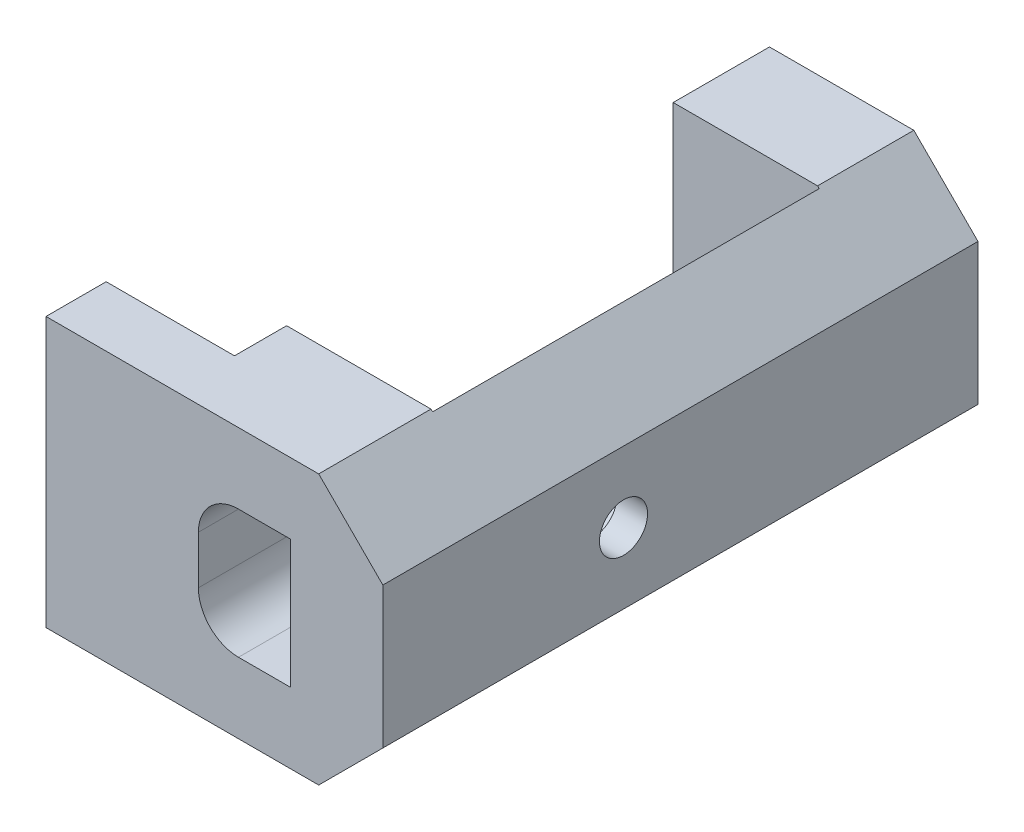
ISO-10303-21;
HEADER;
FILE_DESCRIPTION(('STEP AP214'),'2;1');
FILE_NAME('part.step','',(''),(''),'','','');
FILE_SCHEMA(('AUTOMOTIVE_DESIGN { 1 0 10303 214 1 1 1 1 }'));
ENDSEC;
DATA;
#1=APPLICATION_CONTEXT('core data for automotive mechanical design processes');
#2=APPLICATION_PROTOCOL_DEFINITION('international standard','automotive_design',2000,#1);
#3=PRODUCT_CONTEXT('',#1,'mechanical');
#4=PRODUCT('Part','Part','',(#3));
#5=PRODUCT_RELATED_PRODUCT_CATEGORY('part','',(#4));
#6=PRODUCT_DEFINITION_FORMATION('','',#4);
#7=PRODUCT_DEFINITION_CONTEXT('part definition',#1,'design');
#8=PRODUCT_DEFINITION('design','',#6,#7);
#9=PRODUCT_DEFINITION_SHAPE('','',#8);
#10=(LENGTH_UNIT() NAMED_UNIT(*) SI_UNIT(.MILLI.,.METRE.));
#11=(NAMED_UNIT(*) PLANE_ANGLE_UNIT() SI_UNIT($,.RADIAN.));
#12=(NAMED_UNIT(*) SI_UNIT($,.STERADIAN.) SOLID_ANGLE_UNIT());
#13=UNCERTAINTY_MEASURE_WITH_UNIT(LENGTH_MEASURE(1.E-05),#10,'distance_accuracy_value','');
#14=(GEOMETRIC_REPRESENTATION_CONTEXT(3) GLOBAL_UNCERTAINTY_ASSIGNED_CONTEXT((#13)) GLOBAL_UNIT_ASSIGNED_CONTEXT((#10,
#11,#12)) REPRESENTATION_CONTEXT('',''));
#15=CARTESIAN_POINT('',(0.,0.,0.));
#16=DIRECTION('',(0.,0.,1.));
#17=DIRECTION('',(1.,0.,0.));
#18=AXIS2_PLACEMENT_3D('',#15,#16,#17);
#19=CARTESIAN_POINT('',(0.,16.8,0.));
#20=DIRECTION('',(0.,-1.,0.));
#21=DIRECTION('',(0.,0.,-1.));
#22=AXIS2_PLACEMENT_3D('',#19,#20,#21);
#23=PLANE('',#22);
#24=DIRECTION('',(1.,0.,0.));
#25=VECTOR('',#24,1.);
#26=CARTESIAN_POINT('',(0.,16.8,-4.));
#27=LINE('',#26,#25);
#28=CARTESIAN_POINT('',(0.,16.8,-4.));
#29=VERTEX_POINT('',#28);
#30=CARTESIAN_POINT('',(8.99999999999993,16.8,-4.));
#31=VERTEX_POINT('',#30);
#32=EDGE_CURVE('E226',#29,#31,#27,.T.);
#33=ORIENTED_EDGE('',*,*,#32,.F.);
#34=DIRECTION('',(0.,0.,1.));
#35=VECTOR('',#34,1.);
#36=CARTESIAN_POINT('',(0.,16.8,0.));
#37=LINE('',#36,#35);
#38=CARTESIAN_POINT('',(0.,16.8,-0.750000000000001));
#39=VERTEX_POINT('',#38);
#40=EDGE_CURVE('E225',#29,#39,#37,.T.);
#41=ORIENTED_EDGE('',*,*,#40,.T.);
#42=DIRECTION('',(1.,0.,0.));
#43=VECTOR('',#42,1.);
#44=CARTESIAN_POINT('',(-8.,16.8,-0.749999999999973));
#45=LINE('',#44,#43);
#46=CARTESIAN_POINT('',(-8.,16.8,-0.749999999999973));
#47=VERTEX_POINT('',#46);
#48=EDGE_CURVE('E365',#47,#39,#45,.T.);
#49=ORIENTED_EDGE('',*,*,#48,.F.);
#50=DIRECTION('',(0.,0.,-1.));
#51=VECTOR('',#50,1.);
#52=CARTESIAN_POINT('',(-8.,16.8,0.));
#53=LINE('',#52,#51);
#54=CARTESIAN_POINT('',(-7.99999999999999,16.8,3.00000000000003));
#55=VERTEX_POINT('',#54);
#56=EDGE_CURVE('E363',#55,#47,#53,.T.);
#57=ORIENTED_EDGE('',*,*,#56,.F.);
#58=DIRECTION('',(-1.,0.,0.));
#59=VECTOR('',#58,1.);
#60=CARTESIAN_POINT('',(8.99999999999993,16.8,3.));
#61=LINE('',#60,#59);
#62=CARTESIAN_POINT('',(8.99999999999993,16.8,3.));
#63=VERTEX_POINT('',#62);
#64=EDGE_CURVE('E382',#63,#55,#61,.T.);
#65=ORIENTED_EDGE('',*,*,#64,.F.);
#66=DIRECTION('',(0.,0.,-1.));
#67=VECTOR('',#66,1.);
#68=CARTESIAN_POINT('',(8.99999999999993,16.8,0.));
#69=LINE('',#68,#67);
#70=EDGE_CURVE('E256',#63,#31,#69,.T.);
#71=ORIENTED_EDGE('',*,*,#70,.T.);
#72=EDGE_LOOP('',(#33,#41,#49,#57,#65,#71));
#73=FACE_BOUND('',#72,.T.);
#74=ADVANCED_FACE('F35',(#73),#23,.F.);
#75=CARTESIAN_POINT('',(0.,16.8,0.));
#76=DIRECTION('',(1.,0.,0.));
#77=DIRECTION('',(0.,0.,-1.));
#78=AXIS2_PLACEMENT_3D('',#75,#76,#77);
#79=PLANE('',#78);
#80=DIRECTION('',(0.,1.,0.));
#81=VECTOR('',#80,1.);
#82=CARTESIAN_POINT('',(0.,0.,-4.));
#83=LINE('',#82,#81);
#84=CARTESIAN_POINT('',(0.,0.,-4.));
#85=VERTEX_POINT('',#84);
#86=EDGE_CURVE('E211',#85,#29,#83,.T.);
#87=ORIENTED_EDGE('',*,*,#86,.F.);
#88=DIRECTION('',(0.,0.,1.));
#89=VECTOR('',#88,1.);
#90=CARTESIAN_POINT('',(0.,0.,0.));
#91=LINE('',#90,#89);
#92=CARTESIAN_POINT('',(0.,0.,-0.750000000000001));
#93=VERTEX_POINT('',#92);
#94=EDGE_CURVE('E223',#85,#93,#91,.T.);
#95=ORIENTED_EDGE('',*,*,#94,.T.);
#96=DIRECTION('',(0.,1.,0.));
#97=VECTOR('',#96,1.);
#98=CARTESIAN_POINT('',(0.,0.,-0.750000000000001));
#99=LINE('',#98,#97);
#100=EDGE_CURVE('E344',#93,#39,#99,.T.);
#101=ORIENTED_EDGE('',*,*,#100,.T.);
#102=ORIENTED_EDGE('',*,*,#40,.F.);
#103=EDGE_LOOP('',(#87,#95,#101,#102));
#104=FACE_BOUND('',#103,.T.);
#105=ADVANCED_FACE('F221',(#104),#79,.F.);
#106=CARTESIAN_POINT('',(0.,0.,0.));
#107=DIRECTION('',(0.,-1.,0.));
#108=DIRECTION('',(0.,0.,-1.));
#109=AXIS2_PLACEMENT_3D('',#106,#107,#108);
#110=PLANE('',#109);
#111=ORIENTED_EDGE('',*,*,#94,.F.);
#112=DIRECTION('',(-1.,0.,0.));
#113=VECTOR('',#112,1.);
#114=CARTESIAN_POINT('',(8.99999999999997,0.,-4.));
#115=LINE('',#114,#113);
#116=CARTESIAN_POINT('',(8.99999999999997,0.,-4.));
#117=VERTEX_POINT('',#116);
#118=EDGE_CURVE('E208',#117,#85,#115,.T.);
#119=ORIENTED_EDGE('',*,*,#118,.F.);
#120=DIRECTION('',(0.,0.,1.));
#121=VECTOR('',#120,1.);
#122=CARTESIAN_POINT('',(8.99999999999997,0.,0.));
#123=LINE('',#122,#121);
#124=CARTESIAN_POINT('',(8.99999999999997,0.,3.));
#125=VERTEX_POINT('',#124);
#126=EDGE_CURVE('E270',#117,#125,#123,.T.);
#127=ORIENTED_EDGE('',*,*,#126,.T.);
#128=DIRECTION('',(1.,0.,0.));
#129=VECTOR('',#128,1.);
#130=CARTESIAN_POINT('',(0.,0.,3.));
#131=LINE('',#130,#129);
#132=CARTESIAN_POINT('',(-7.99999999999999,0.,3.00000000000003));
#133=VERTEX_POINT('',#132);
#134=EDGE_CURVE('E370',#133,#125,#131,.T.);
#135=ORIENTED_EDGE('',*,*,#134,.F.);
#136=DIRECTION('',(0.,0.,1.));
#137=VECTOR('',#136,1.);
#138=CARTESIAN_POINT('',(-8.,0.,0.));
#139=LINE('',#138,#137);
#140=CARTESIAN_POINT('',(-8.,0.,-0.749999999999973));
#141=VERTEX_POINT('',#140);
#142=EDGE_CURVE('E357',#141,#133,#139,.T.);
#143=ORIENTED_EDGE('',*,*,#142,.F.);
#144=DIRECTION('',(1.,0.,0.));
#145=VECTOR('',#144,1.);
#146=CARTESIAN_POINT('',(-8.,0.,-0.749999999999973));
#147=LINE('',#146,#145);
#148=EDGE_CURVE('E230',#141,#93,#147,.T.);
#149=ORIENTED_EDGE('',*,*,#148,.T.);
#150=EDGE_LOOP('',(#111,#119,#127,#135,#143,#149));
#151=FACE_BOUND('',#150,.T.);
#152=ADVANCED_FACE('F228',(#151),#110,.T.);
#153=CARTESIAN_POINT('',(4.,9.9,-5.));
#154=DIRECTION('',(0.,0.,1.));
#155=DIRECTION('',(1.,0.,0.));
#156=AXIS2_PLACEMENT_3D('',#153,#154,#155);
#157=CYLINDRICAL_SURFACE('',#156,2.5);
#158=CARTESIAN_POINT('',(4.,9.9,-4.));
#159=DIRECTION('',(0.,0.,-1.));
#160=DIRECTION('',(-1.,0.,0.));
#161=AXIS2_PLACEMENT_3D('',#158,#159,#160);
#162=CIRCLE('',#161,2.5);
#163=CARTESIAN_POINT('',(4.,12.4,-4.));
#164=VERTEX_POINT('',#163);
#165=CARTESIAN_POINT('',(1.5,9.9,-4.));
#166=VERTEX_POINT('',#165);
#167=EDGE_CURVE('E57',#164,#166,#162,.F.);
#168=ORIENTED_EDGE('',*,*,#167,.F.);
#169=DIRECTION('',(0.,0.,1.));
#170=VECTOR('',#169,1.);
#171=CARTESIAN_POINT('',(4.,12.4,-5.));
#172=LINE('',#171,#170);
#173=CARTESIAN_POINT('',(4.,12.4,3.));
#174=VERTEX_POINT('',#173);
#175=EDGE_CURVE('E342',#164,#174,#172,.T.);
#176=ORIENTED_EDGE('',*,*,#175,.T.);
#177=CARTESIAN_POINT('',(4.,9.9,3.));
#178=DIRECTION('',(0.,0.,1.));
#179=DIRECTION('',(1.,0.,0.));
#180=AXIS2_PLACEMENT_3D('',#177,#178,#179);
#181=CIRCLE('',#180,2.5);
#182=CARTESIAN_POINT('',(1.5,9.9,3.));
#183=VERTEX_POINT('',#182);
#184=EDGE_CURVE('E323',#174,#183,#181,.T.);
#185=ORIENTED_EDGE('',*,*,#184,.T.);
#186=DIRECTION('',(0.,0.,1.));
#187=VECTOR('',#186,1.);
#188=CARTESIAN_POINT('',(1.5,9.9,-5.));
#189=LINE('',#188,#187);
#190=EDGE_CURVE('E341',#166,#183,#189,.T.);
#191=ORIENTED_EDGE('',*,*,#190,.F.);
#192=EDGE_LOOP('',(#168,#176,#185,#191));
#193=FACE_BOUND('',#192,.T.);
#194=ADVANCED_FACE('F486',(#193),#157,.F.);
#195=CARTESIAN_POINT('',(7.25,12.4,-5.));
#196=DIRECTION('',(0.,1.,0.));
#197=DIRECTION('',(0.,0.,1.));
#198=AXIS2_PLACEMENT_3D('',#195,#196,#197);
#199=PLANE('',#198);
#200=DIRECTION('',(-1.,0.,0.));
#201=VECTOR('',#200,1.);
#202=CARTESIAN_POINT('',(7.25,12.4,-4.));
#203=LINE('',#202,#201);
#204=CARTESIAN_POINT('',(7.25,12.4,-4.));
#205=VERTEX_POINT('',#204);
#206=EDGE_CURVE('E299',#205,#164,#203,.T.);
#207=ORIENTED_EDGE('',*,*,#206,.F.);
#208=DIRECTION('',(0.,0.,1.));
#209=VECTOR('',#208,1.);
#210=CARTESIAN_POINT('',(7.25,12.4,-5.));
#211=LINE('',#210,#209);
#212=CARTESIAN_POINT('',(7.25,12.4,3.));
#213=VERTEX_POINT('',#212);
#214=EDGE_CURVE('E345',#205,#213,#211,.T.);
#215=ORIENTED_EDGE('',*,*,#214,.T.);
#216=DIRECTION('',(-1.,0.,0.));
#217=VECTOR('',#216,1.);
#218=CARTESIAN_POINT('',(7.25,12.4,3.));
#219=LINE('',#218,#217);
#220=EDGE_CURVE('E338',#213,#174,#219,.T.);
#221=ORIENTED_EDGE('',*,*,#220,.T.);
#222=ORIENTED_EDGE('',*,*,#175,.F.);
#223=EDGE_LOOP('',(#207,#215,#221,#222));
#224=FACE_BOUND('',#223,.T.);
#225=ADVANCED_FACE('F490',(#224),#199,.F.);
#226=CARTESIAN_POINT('',(7.25,12.4,-5.));
#227=DIRECTION('',(1.,0.,0.));
#228=DIRECTION('',(0.,0.,-1.));
#229=AXIS2_PLACEMENT_3D('',#226,#227,#228);
#230=PLANE('',#229);
#231=DIRECTION('',(0.,1.,0.));
#232=VECTOR('',#231,1.);
#233=CARTESIAN_POINT('',(7.25,12.4,-4.));
#234=LINE('',#233,#232);
#235=CARTESIAN_POINT('',(7.25,4.4,-4.));
#236=VERTEX_POINT('',#235);
#237=EDGE_CURVE('E297',#236,#205,#234,.T.);
#238=ORIENTED_EDGE('',*,*,#237,.F.);
#239=DIRECTION('',(0.,0.,1.));
#240=VECTOR('',#239,1.);
#241=CARTESIAN_POINT('',(7.25,4.4,-5.));
#242=LINE('',#241,#240);
#243=CARTESIAN_POINT('',(7.25,4.4,3.));
#244=VERTEX_POINT('',#243);
#245=EDGE_CURVE('E347',#236,#244,#242,.T.);
#246=ORIENTED_EDGE('',*,*,#245,.T.);
#247=DIRECTION('',(0.,1.,0.));
#248=VECTOR('',#247,1.);
#249=CARTESIAN_POINT('',(7.25,12.4,3.));
#250=LINE('',#249,#248);
#251=EDGE_CURVE('E335',#244,#213,#250,.T.);
#252=ORIENTED_EDGE('',*,*,#251,.T.);
#253=ORIENTED_EDGE('',*,*,#214,.F.);
#254=EDGE_LOOP('',(#238,#246,#252,#253));
#255=FACE_BOUND('',#254,.T.);
#256=ADVANCED_FACE('F680',(#255),#230,.F.);
#257=CARTESIAN_POINT('',(7.25,4.4,-5.));
#258=DIRECTION('',(0.,-1.,0.));
#259=DIRECTION('',(1.,0.,0.));
#260=AXIS2_PLACEMENT_3D('',#257,#258,#259);
#261=PLANE('',#260);
#262=DIRECTION('',(1.,0.,0.));
#263=VECTOR('',#262,1.);
#264=CARTESIAN_POINT('',(7.25,4.4,-4.));
#265=LINE('',#264,#263);
#266=CARTESIAN_POINT('',(4.,4.4,-4.));
#267=VERTEX_POINT('',#266);
#268=EDGE_CURVE('E290',#267,#236,#265,.T.);
#269=ORIENTED_EDGE('',*,*,#268,.F.);
#270=DIRECTION('',(0.,0.,1.));
#271=VECTOR('',#270,1.);
#272=CARTESIAN_POINT('',(4.,4.4,-5.));
#273=LINE('',#272,#271);
#274=CARTESIAN_POINT('',(4.,4.4,3.));
#275=VERTEX_POINT('',#274);
#276=EDGE_CURVE('E349',#267,#275,#273,.T.);
#277=ORIENTED_EDGE('',*,*,#276,.T.);
#278=DIRECTION('',(1.,0.,0.));
#279=VECTOR('',#278,1.);
#280=CARTESIAN_POINT('',(7.25,4.4,3.));
#281=LINE('',#280,#279);
#282=EDGE_CURVE('E332',#275,#244,#281,.T.);
#283=ORIENTED_EDGE('',*,*,#282,.T.);
#284=ORIENTED_EDGE('',*,*,#245,.F.);
#285=EDGE_LOOP('',(#269,#277,#283,#284));
#286=FACE_BOUND('',#285,.T.);
#287=ADVANCED_FACE('F506',(#286),#261,.F.);
#288=CARTESIAN_POINT('',(4.,6.9,-5.));
#289=DIRECTION('',(0.,0.,1.));
#290=DIRECTION('',(1.,0.,0.));
#291=AXIS2_PLACEMENT_3D('',#288,#289,#290);
#292=CYLINDRICAL_SURFACE('',#291,2.5);
#293=CARTESIAN_POINT('',(4.,6.9,-4.));
#294=DIRECTION('',(0.,0.,-1.));
#295=DIRECTION('',(-1.,0.,0.));
#296=AXIS2_PLACEMENT_3D('',#293,#294,#295);
#297=CIRCLE('',#296,2.5);
#298=CARTESIAN_POINT('',(1.5,6.9,-4.));
#299=VERTEX_POINT('',#298);
#300=EDGE_CURVE('E287',#299,#267,#297,.F.);
#301=ORIENTED_EDGE('',*,*,#300,.F.);
#302=DIRECTION('',(0.,0.,1.));
#303=VECTOR('',#302,1.);
#304=CARTESIAN_POINT('',(1.5,6.9,-5.));
#305=LINE('',#304,#303);
#306=CARTESIAN_POINT('',(1.5,6.9,3.));
#307=VERTEX_POINT('',#306);
#308=EDGE_CURVE('E351',#299,#307,#305,.T.);
#309=ORIENTED_EDGE('',*,*,#308,.T.);
#310=CARTESIAN_POINT('',(4.,6.9,3.));
#311=DIRECTION('',(0.,0.,1.));
#312=DIRECTION('',(1.,0.,0.));
#313=AXIS2_PLACEMENT_3D('',#310,#311,#312);
#314=CIRCLE('',#313,2.5);
#315=EDGE_CURVE('E329',#307,#275,#314,.T.);
#316=ORIENTED_EDGE('',*,*,#315,.T.);
#317=ORIENTED_EDGE('',*,*,#276,.F.);
#318=EDGE_LOOP('',(#301,#309,#316,#317));
#319=FACE_BOUND('',#318,.T.);
#320=ADVANCED_FACE('F500',(#319),#292,.F.);
#321=CARTESIAN_POINT('',(1.5,9.9,-5.));
#322=DIRECTION('',(-1.,0.,0.));
#323=DIRECTION('',(0.,0.,1.));
#324=AXIS2_PLACEMENT_3D('',#321,#322,#323);
#325=PLANE('',#324);
#326=DIRECTION('',(0.,-1.,0.));
#327=VECTOR('',#326,1.);
#328=CARTESIAN_POINT('',(1.5,9.9,-4.));
#329=LINE('',#328,#327);
#330=EDGE_CURVE('E11',#166,#299,#329,.T.);
#331=ORIENTED_EDGE('',*,*,#330,.F.);
#332=ORIENTED_EDGE('',*,*,#190,.T.);
#333=DIRECTION('',(0.,-1.,0.));
#334=VECTOR('',#333,1.);
#335=CARTESIAN_POINT('',(1.5,9.9,3.));
#336=LINE('',#335,#334);
#337=EDGE_CURVE('E326',#183,#307,#336,.T.);
#338=ORIENTED_EDGE('',*,*,#337,.T.);
#339=ORIENTED_EDGE('',*,*,#308,.F.);
#340=EDGE_LOOP('',(#331,#332,#338,#339));
#341=FACE_BOUND('',#340,.T.);
#342=ADVANCED_FACE('F494',(#341),#325,.F.);
#343=DIRECTION('',(0.,0.,1.));
#344=VECTOR('',#343,1.);
#345=CARTESIAN_POINT('',(0.,0.,-33.1));
#346=LINE('',#345,#344);
#347=CARTESIAN_POINT('',(0.,0.,-34.1));
#348=VERTEX_POINT('',#347);
#349=CARTESIAN_POINT('',(0.,0.,-28.1));
#350=VERTEX_POINT('',#349);
#351=EDGE_CURVE('E232',#348,#350,#346,.T.);
#352=ORIENTED_EDGE('',*,*,#351,.F.);
#353=DIRECTION('',(-1.,0.,0.));
#354=VECTOR('',#353,1.);
#355=CARTESIAN_POINT('',(0.,0.,-34.1));
#356=LINE('',#355,#354);
#357=CARTESIAN_POINT('',(8.99999999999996,0.,-34.1));
#358=VERTEX_POINT('',#357);
#359=EDGE_CURVE('E276',#358,#348,#356,.T.);
#360=ORIENTED_EDGE('',*,*,#359,.F.);
#361=DIRECTION('',(0.,0.,1.));
#362=VECTOR('',#361,1.);
#363=CARTESIAN_POINT('',(8.99999999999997,0.,0.));
#364=LINE('',#363,#362);
#365=CARTESIAN_POINT('',(8.99999999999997,0.,-28.1));
#366=VERTEX_POINT('',#365);
#367=EDGE_CURVE('E43',#358,#366,#364,.T.);
#368=ORIENTED_EDGE('',*,*,#367,.T.);
#369=DIRECTION('',(1.,0.,0.));
#370=VECTOR('',#369,1.);
#371=CARTESIAN_POINT('',(0.,0.,-28.1));
#372=LINE('',#371,#370);
#373=EDGE_CURVE('E235',#350,#366,#372,.T.);
#374=ORIENTED_EDGE('',*,*,#373,.F.);
#375=EDGE_LOOP('',(#352,#360,#368,#374));
#376=FACE_BOUND('',#375,.T.);
#377=ADVANCED_FACE('F274',(#376),#110,.T.);
#378=CARTESIAN_POINT('',(3.,8.40000000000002,-12.));
#379=DIRECTION('',(1.,0.,0.));
#380=DIRECTION('',(0.,0.,-1.));
#381=AXIS2_PLACEMENT_3D('',#378,#379,#380);
#382=CYLINDRICAL_SURFACE('',#381,1.5);
#383=CARTESIAN_POINT('',(13.,8.40000000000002,-12.));
#384=DIRECTION('',(1.,0.,0.));
#385=DIRECTION('',(0.,0.,-1.));
#386=AXIS2_PLACEMENT_3D('',#383,#384,#385);
#387=CIRCLE('',#386,1.5);
#388=CARTESIAN_POINT('',(13.,8.40000000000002,-13.5));
#389=VERTEX_POINT('',#388);
#390=EDGE_CURVE('E233',#389,#389,#387,.T.);
#391=ORIENTED_EDGE('',*,*,#390,.T.);
#392=EDGE_LOOP('',(#391));
#393=FACE_BOUND('',#392,.T.);
#394=CARTESIAN_POINT('',(11.1,8.40000000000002,-12.));
#395=DIRECTION('',(-1.,0.,0.));
#396=DIRECTION('',(0.,0.,1.));
#397=AXIS2_PLACEMENT_3D('',#394,#395,#396);
#398=CIRCLE('',#397,1.5);
#399=CARTESIAN_POINT('',(11.1,8.40000000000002,-10.5));
#400=VERTEX_POINT('',#399);
#401=EDGE_CURVE('E238',#400,#400,#398,.F.);
#402=ORIENTED_EDGE('',*,*,#401,.F.);
#403=EDGE_LOOP('',(#402));
#404=FACE_BOUND('',#403,.T.);
#405=ADVANCED_FACE('F458',(#393,#404),#382,.F.);
#406=CARTESIAN_POINT('',(13.,16.8,0.));
#407=DIRECTION('',(-1.,0.,0.));
#408=DIRECTION('',(0.,0.,1.));
#409=AXIS2_PLACEMENT_3D('',#406,#407,#408);
#410=PLANE('',#409);
#411=ORIENTED_EDGE('',*,*,#390,.F.);
#412=EDGE_LOOP('',(#411));
#413=FACE_BOUND('',#412,.T.);
#414=DIRECTION('',(0.,0.,-1.));
#415=VECTOR('',#414,1.);
#416=CARTESIAN_POINT('',(13.,4.00000000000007,-33.1));
#417=LINE('',#416,#415);
#418=CARTESIAN_POINT('',(13.,4.00000000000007,3.));
#419=VERTEX_POINT('',#418);
#420=CARTESIAN_POINT('',(13.,4.00000000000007,-34.1));
#421=VERTEX_POINT('',#420);
#422=EDGE_CURVE('E266',#419,#421,#417,.T.);
#423=ORIENTED_EDGE('',*,*,#422,.T.);
#424=DIRECTION('',(0.,-1.,0.));
#425=VECTOR('',#424,1.);
#426=CARTESIAN_POINT('',(13.,4.00000000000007,-34.1));
#427=LINE('',#426,#425);
#428=CARTESIAN_POINT('',(13.,12.8,-34.1));
#429=VERTEX_POINT('',#428);
#430=EDGE_CURVE('E314',#429,#421,#427,.T.);
#431=ORIENTED_EDGE('',*,*,#430,.F.);
#432=DIRECTION('',(0.,0.,1.));
#433=VECTOR('',#432,1.);
#434=CARTESIAN_POINT('',(13.,12.8,0.));
#435=LINE('',#434,#433);
#436=CARTESIAN_POINT('',(13.,12.8,3.));
#437=VERTEX_POINT('',#436);
#438=EDGE_CURVE('E268',#429,#437,#435,.T.);
#439=ORIENTED_EDGE('',*,*,#438,.T.);
#440=DIRECTION('',(0.,1.,0.));
#441=VECTOR('',#440,1.);
#442=CARTESIAN_POINT('',(13.,4.00000000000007,3.));
#443=LINE('',#442,#441);
#444=EDGE_CURVE('E376',#419,#437,#443,.T.);
#445=ORIENTED_EDGE('',*,*,#444,.F.);
#446=EDGE_LOOP('',(#423,#431,#439,#445));
#447=FACE_BOUND('',#446,.T.);
#448=ADVANCED_FACE('F449',(#413,#447),#410,.F.);
#449=CARTESIAN_POINT('',(0.,16.8,-33.1));
#450=DIRECTION('',(1.,0.,0.));
#451=DIRECTION('',(0.,0.,-1.));
#452=AXIS2_PLACEMENT_3D('',#449,#450,#451);
#453=PLANE('',#452);
#454=CARTESIAN_POINT('',(1.01164552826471E-13,8.4,-31.1));
#455=DIRECTION('',(-1.,0.,0.));
#456=DIRECTION('',(0.,0.,1.));
#457=AXIS2_PLACEMENT_3D('',#454,#455,#456);
#458=CIRCLE('',#457,1.);
#459=CARTESIAN_POINT('',(0.,8.4,-30.1));
#460=VERTEX_POINT('',#459);
#461=EDGE_CURVE('E302',#460,#460,#458,.T.);
#462=ORIENTED_EDGE('',*,*,#461,.F.);
#463=EDGE_LOOP('',(#462));
#464=FACE_BOUND('',#463,.T.);
#465=ORIENTED_EDGE('',*,*,#351,.T.);
#466=DIRECTION('',(0.,-1.,0.));
#467=VECTOR('',#466,1.);
#468=CARTESIAN_POINT('',(0.,16.8,-28.1));
#469=LINE('',#468,#467);
#470=CARTESIAN_POINT('',(0.,16.8,-28.1));
#471=VERTEX_POINT('',#470);
#472=EDGE_CURVE('E248',#471,#350,#469,.T.);
#473=ORIENTED_EDGE('',*,*,#472,.F.);
#474=DIRECTION('',(0.,0.,1.));
#475=VECTOR('',#474,1.);
#476=CARTESIAN_POINT('',(0.,16.8,-33.1));
#477=LINE('',#476,#475);
#478=CARTESIAN_POINT('',(0.,16.8,-34.1));
#479=VERTEX_POINT('',#478);
#480=EDGE_CURVE('E431',#479,#471,#477,.T.);
#481=ORIENTED_EDGE('',*,*,#480,.F.);
#482=DIRECTION('',(0.,1.,0.));
#483=VECTOR('',#482,1.);
#484=CARTESIAN_POINT('',(0.,16.8,-34.1));
#485=LINE('',#484,#483);
#486=EDGE_CURVE('E320',#348,#479,#485,.T.);
#487=ORIENTED_EDGE('',*,*,#486,.F.);
#488=EDGE_LOOP('',(#465,#473,#481,#487));
#489=FACE_BOUND('',#488,.T.);
#490=ADVANCED_FACE('F447',(#464,#489),#453,.F.);
#491=CARTESIAN_POINT('',(0.,16.8,-28.1));
#492=DIRECTION('',(0.,0.,-1.));
#493=DIRECTION('',(-1.,0.,0.));
#494=AXIS2_PLACEMENT_3D('',#491,#492,#493);
#495=PLANE('',#494);
#496=DIRECTION('',(0.,-1.,0.));
#497=VECTOR('',#496,1.);
#498=CARTESIAN_POINT('',(9.09999999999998,16.8,-28.1));
#499=LINE('',#498,#497);
#500=CARTESIAN_POINT('',(9.09999999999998,16.6999999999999,-28.1));
#501=VERTEX_POINT('',#500);
#502=CARTESIAN_POINT('',(9.09999999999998,0.100000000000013,-28.1));
#503=VERTEX_POINT('',#502);
#504=EDGE_CURVE('E246',#501,#503,#499,.T.);
#505=ORIENTED_EDGE('',*,*,#504,.F.);
#506=DIRECTION('',(0.707106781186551,-0.707106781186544,0.));
#507=VECTOR('',#506,1.);
#508=CARTESIAN_POINT('',(8.99999999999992,16.8,-28.1));
#509=LINE('',#508,#507);
#510=CARTESIAN_POINT('',(8.99999999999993,16.8,-28.1));
#511=VERTEX_POINT('',#510);
#512=EDGE_CURVE('E264',#501,#511,#509,.F.);
#513=ORIENTED_EDGE('',*,*,#512,.T.);
#514=DIRECTION('',(1.,0.,0.));
#515=VECTOR('',#514,1.);
#516=CARTESIAN_POINT('',(0.,16.8,-28.1));
#517=LINE('',#516,#515);
#518=EDGE_CURVE('E241',#471,#511,#517,.T.);
#519=ORIENTED_EDGE('',*,*,#518,.F.);
#520=ORIENTED_EDGE('',*,*,#472,.T.);
#521=ORIENTED_EDGE('',*,*,#373,.T.);
#522=DIRECTION('',(0.707106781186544,0.707106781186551,0.));
#523=VECTOR('',#522,1.);
#524=CARTESIAN_POINT('',(13.,4.00000000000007,-28.1));
#525=LINE('',#524,#523);
#526=EDGE_CURVE('E262',#366,#503,#525,.T.);
#527=ORIENTED_EDGE('',*,*,#526,.T.);
#528=EDGE_LOOP('',(#505,#513,#519,#520,#521,#527));
#529=FACE_BOUND('',#528,.T.);
#530=ADVANCED_FACE('F283',(#529),#495,.F.);
#531=CARTESIAN_POINT('',(9.09999999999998,16.8,-5.));
#532=DIRECTION('',(1.,0.,0.));
#533=DIRECTION('',(0.,0.,-1.));
#534=AXIS2_PLACEMENT_3D('',#531,#532,#533);
#535=PLANE('',#534);
#536=DIRECTION('',(0.,-0.474310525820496,-0.880357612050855));
#537=VECTOR('',#536,1.);
#538=CARTESIAN_POINT('',(9.09999999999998,11.3987019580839,-11.9117584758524));
#539=LINE('',#538,#537);
#540=CARTESIAN_POINT('',(9.09999999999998,11.3987019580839,-11.9117584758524));
#541=VERTEX_POINT('',#540);
#542=CARTESIAN_POINT('',(9.09999999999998,9.97577038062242,-14.552831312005));
#543=VERTEX_POINT('',#542);
#544=EDGE_CURVE('E406',#541,#543,#539,.T.);
#545=ORIENTED_EDGE('',*,*,#544,.F.);
#546=DIRECTION('',(0.,0.525256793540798,-0.850943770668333));
#547=VECTOR('',#546,1.);
#548=CARTESIAN_POINT('',(9.09999999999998,9.82293157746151,-9.35892716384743));
#549=LINE('',#548,#547);
#550=CARTESIAN_POINT('',(9.09999999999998,9.82293157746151,-9.35892716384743));
#551=VERTEX_POINT('',#550);
#552=EDGE_CURVE('E384',#551,#541,#549,.T.);
#553=ORIENTED_EDGE('',*,*,#552,.F.);
#554=DIRECTION('',(0.,0.999567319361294,0.0294138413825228));
#555=VECTOR('',#554,1.);
#556=CARTESIAN_POINT('',(9.09999999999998,6.82422961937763,-9.447168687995));
#557=LINE('',#556,#555);
#558=CARTESIAN_POINT('',(9.09999999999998,6.82422961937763,-9.447168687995));
#559=VERTEX_POINT('',#558);
#560=EDGE_CURVE('E389',#559,#551,#557,.T.);
#561=ORIENTED_EDGE('',*,*,#560,.F.);
#562=DIRECTION('',(0.,0.474310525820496,0.880357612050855));
#563=VECTOR('',#562,1.);
#564=CARTESIAN_POINT('',(9.09999999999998,5.40129804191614,-12.0882415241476));
#565=LINE('',#564,#563);
#566=CARTESIAN_POINT('',(9.09999999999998,5.40129804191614,-12.0882415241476));
#567=VERTEX_POINT('',#566);
#568=EDGE_CURVE('E415',#567,#559,#565,.T.);
#569=ORIENTED_EDGE('',*,*,#568,.F.);
#570=DIRECTION('',(0.,-0.525256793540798,0.850943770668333));
#571=VECTOR('',#570,1.);
#572=CARTESIAN_POINT('',(9.09999999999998,6.97706842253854,-14.6410728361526));
#573=LINE('',#572,#571);
#574=CARTESIAN_POINT('',(9.09999999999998,6.97706842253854,-14.6410728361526));
#575=VERTEX_POINT('',#574);
#576=EDGE_CURVE('E412',#575,#567,#573,.T.);
#577=ORIENTED_EDGE('',*,*,#576,.F.);
#578=DIRECTION('',(0.,-0.999567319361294,-0.0294138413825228));
#579=VECTOR('',#578,1.);
#580=CARTESIAN_POINT('',(9.09999999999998,9.97577038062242,-14.552831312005));
#581=LINE('',#580,#579);
#582=EDGE_CURVE('E409',#543,#575,#581,.T.);
#583=ORIENTED_EDGE('',*,*,#582,.F.);
#584=EDGE_LOOP('',(#545,#553,#561,#569,#577,#583));
#585=FACE_BOUND('',#584,.T.);
#586=DIRECTION('',(0.,0.,1.));
#587=VECTOR('',#586,1.);
#588=CARTESIAN_POINT('',(9.09999999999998,0.100000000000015,0.));
#589=LINE('',#588,#587);
#590=CARTESIAN_POINT('',(9.09999999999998,0.100000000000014,-4.));
#591=VERTEX_POINT('',#590);
#592=EDGE_CURVE('E50',#503,#591,#589,.T.);
#593=ORIENTED_EDGE('',*,*,#592,.T.);
#594=DIRECTION('',(0.,-1.,0.));
#595=VECTOR('',#594,1.);
#596=CARTESIAN_POINT('',(9.09999999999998,16.6999999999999,-4.));
#597=LINE('',#596,#595);
#598=CARTESIAN_POINT('',(9.09999999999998,16.6999999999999,-4.));
#599=VERTEX_POINT('',#598);
#600=EDGE_CURVE('E288',#599,#591,#597,.T.);
#601=ORIENTED_EDGE('',*,*,#600,.F.);
#602=DIRECTION('',(0.,0.,1.));
#603=VECTOR('',#602,1.);
#604=CARTESIAN_POINT('',(9.09999999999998,16.6999999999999,0.));
#605=LINE('',#604,#603);
#606=EDGE_CURVE('E260',#599,#501,#605,.F.);
#607=ORIENTED_EDGE('',*,*,#606,.T.);
#608=ORIENTED_EDGE('',*,*,#504,.T.);
#609=EDGE_LOOP('',(#593,#601,#607,#608));
#610=FACE_BOUND('',#609,.T.);
#611=ADVANCED_FACE('F456',(#585,#610),#535,.F.);
#612=ORIENTED_EDGE('',*,*,#518,.T.);
#613=DIRECTION('',(0.,0.,-1.));
#614=VECTOR('',#613,1.);
#615=CARTESIAN_POINT('',(8.99999999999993,16.8,0.));
#616=LINE('',#615,#614);
#617=CARTESIAN_POINT('',(8.99999999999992,16.8,-34.1));
#618=VERTEX_POINT('',#617);
#619=EDGE_CURVE('E251',#511,#618,#616,.T.);
#620=ORIENTED_EDGE('',*,*,#619,.T.);
#621=DIRECTION('',(1.,0.,0.));
#622=VECTOR('',#621,1.);
#623=CARTESIAN_POINT('',(8.99999999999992,16.8,-34.1));
#624=LINE('',#623,#622);
#625=EDGE_CURVE('E306',#479,#618,#624,.T.);
#626=ORIENTED_EDGE('',*,*,#625,.F.);
#627=ORIENTED_EDGE('',*,*,#480,.T.);
#628=EDGE_LOOP('',(#612,#620,#626,#627));
#629=FACE_BOUND('',#628,.T.);
#630=ADVANCED_FACE('F436',(#629),#23,.F.);
#631=CARTESIAN_POINT('',(11.1,0.,0.));
#632=DIRECTION('',(-1.,0.,0.));
#633=DIRECTION('',(0.,0.,1.));
#634=AXIS2_PLACEMENT_3D('',#631,#632,#633);
#635=PLANE('',#634);
#636=DIRECTION('',(0.,0.525256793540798,-0.850943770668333));
#637=VECTOR('',#636,1.);
#638=CARTESIAN_POINT('',(11.1,9.82293157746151,-9.35892716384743));
#639=LINE('',#638,#637);
#640=CARTESIAN_POINT('',(11.1,9.82293157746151,-9.35892716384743));
#641=VERTEX_POINT('',#640);
#642=CARTESIAN_POINT('',(11.1,11.3987019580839,-11.9117584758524));
#643=VERTEX_POINT('',#642);
#644=EDGE_CURVE('E385',#641,#643,#639,.T.);
#645=ORIENTED_EDGE('',*,*,#644,.T.);
#646=DIRECTION('',(0.,-0.474310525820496,-0.880357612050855));
#647=VECTOR('',#646,1.);
#648=CARTESIAN_POINT('',(11.1,11.3987019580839,-11.9117584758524));
#649=LINE('',#648,#647);
#650=CARTESIAN_POINT('',(11.1,9.97577038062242,-14.552831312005));
#651=VERTEX_POINT('',#650);
#652=EDGE_CURVE('E388',#643,#651,#649,.T.);
#653=ORIENTED_EDGE('',*,*,#652,.T.);
#654=DIRECTION('',(0.,-0.999567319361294,-0.0294138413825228));
#655=VECTOR('',#654,1.);
#656=CARTESIAN_POINT('',(11.1,9.97577038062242,-14.552831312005));
#657=LINE('',#656,#655);
#658=CARTESIAN_POINT('',(11.1,6.97706842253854,-14.6410728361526));
#659=VERTEX_POINT('',#658);
#660=EDGE_CURVE('E392',#651,#659,#657,.T.);
#661=ORIENTED_EDGE('',*,*,#660,.T.);
#662=DIRECTION('',(0.,-0.525256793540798,0.850943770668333));
#663=VECTOR('',#662,1.);
#664=CARTESIAN_POINT('',(11.1,6.97706842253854,-14.6410728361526));
#665=LINE('',#664,#663);
#666=CARTESIAN_POINT('',(11.1,5.40129804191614,-12.0882415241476));
#667=VERTEX_POINT('',#666);
#668=EDGE_CURVE('E395',#659,#667,#665,.T.);
#669=ORIENTED_EDGE('',*,*,#668,.T.);
#670=DIRECTION('',(0.,0.474310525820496,0.880357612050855));
#671=VECTOR('',#670,1.);
#672=CARTESIAN_POINT('',(11.1,5.40129804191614,-12.0882415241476));
#673=LINE('',#672,#671);
#674=CARTESIAN_POINT('',(11.1,6.82422961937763,-9.447168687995));
#675=VERTEX_POINT('',#674);
#676=EDGE_CURVE('E398',#667,#675,#673,.T.);
#677=ORIENTED_EDGE('',*,*,#676,.T.);
#678=DIRECTION('',(0.,0.999567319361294,0.0294138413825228));
#679=VECTOR('',#678,1.);
#680=CARTESIAN_POINT('',(11.1,6.82422961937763,-9.447168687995));
#681=LINE('',#680,#679);
#682=EDGE_CURVE('E401',#675,#641,#681,.T.);
#683=ORIENTED_EDGE('',*,*,#682,.T.);
#684=EDGE_LOOP('',(#645,#653,#661,#669,#677,#683));
#685=FACE_BOUND('',#684,.T.);
#686=ORIENTED_EDGE('',*,*,#401,.T.);
#687=EDGE_LOOP('',(#686));
#688=FACE_BOUND('',#687,.T.);
#689=ADVANCED_FACE('F472',(#685,#688),#635,.T.);
#690=CARTESIAN_POINT('',(11.1,9.82293157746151,-9.35892716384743));
#691=DIRECTION('',(0.,0.850943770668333,0.525256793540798));
#692=DIRECTION('',(0.,-0.525256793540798,0.850943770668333));
#693=AXIS2_PLACEMENT_3D('',#690,#691,#692);
#694=PLANE('',#693);
#695=ORIENTED_EDGE('',*,*,#552,.T.);
#696=DIRECTION('',(-1.,0.,0.));
#697=VECTOR('',#696,1.);
#698=CARTESIAN_POINT('',(11.1,11.3987019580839,-11.9117584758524));
#699=LINE('',#698,#697);
#700=EDGE_CURVE('E404',#643,#541,#699,.T.);
#701=ORIENTED_EDGE('',*,*,#700,.F.);
#702=ORIENTED_EDGE('',*,*,#644,.F.);
#703=DIRECTION('',(-1.,0.,0.));
#704=VECTOR('',#703,1.);
#705=CARTESIAN_POINT('',(11.1,9.82293157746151,-9.35892716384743));
#706=LINE('',#705,#704);
#707=EDGE_CURVE('E254',#641,#551,#706,.T.);
#708=ORIENTED_EDGE('',*,*,#707,.T.);
#709=EDGE_LOOP('',(#695,#701,#702,#708));
#710=FACE_BOUND('',#709,.T.);
#711=ADVANCED_FACE('F477',(#710),#694,.F.);
#712=CARTESIAN_POINT('',(11.1,6.82422961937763,-9.447168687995));
#713=DIRECTION('',(0.,-0.0294138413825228,0.999567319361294));
#714=DIRECTION('',(0.,-0.999567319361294,-0.0294138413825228));
#715=AXIS2_PLACEMENT_3D('',#712,#713,#714);
#716=PLANE('',#715);
#717=ORIENTED_EDGE('',*,*,#560,.T.);
#718=ORIENTED_EDGE('',*,*,#707,.F.);
#719=ORIENTED_EDGE('',*,*,#682,.F.);
#720=DIRECTION('',(-1.,0.,0.));
#721=VECTOR('',#720,1.);
#722=CARTESIAN_POINT('',(11.1,6.82422961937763,-9.447168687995));
#723=LINE('',#722,#721);
#724=EDGE_CURVE('E421',#675,#559,#723,.T.);
#725=ORIENTED_EDGE('',*,*,#724,.T.);
#726=EDGE_LOOP('',(#717,#718,#719,#725));
#727=FACE_BOUND('',#726,.T.);
#728=ADVANCED_FACE('F523',(#727),#716,.F.);
#729=CARTESIAN_POINT('',(11.1,5.40129804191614,-12.0882415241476));
#730=DIRECTION('',(0.,-0.880357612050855,0.474310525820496));
#731=DIRECTION('',(0.,-0.474310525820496,-0.880357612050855));
#732=AXIS2_PLACEMENT_3D('',#729,#730,#731);
#733=PLANE('',#732);
#734=ORIENTED_EDGE('',*,*,#568,.T.);
#735=ORIENTED_EDGE('',*,*,#724,.F.);
#736=ORIENTED_EDGE('',*,*,#676,.F.);
#737=DIRECTION('',(-1.,0.,0.));
#738=VECTOR('',#737,1.);
#739=CARTESIAN_POINT('',(11.1,5.40129804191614,-12.0882415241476));
#740=LINE('',#739,#738);
#741=EDGE_CURVE('E423',#667,#567,#740,.T.);
#742=ORIENTED_EDGE('',*,*,#741,.T.);
#743=EDGE_LOOP('',(#734,#735,#736,#742));
#744=FACE_BOUND('',#743,.T.);
#745=ADVANCED_FACE('F526',(#744),#733,.F.);
#746=CARTESIAN_POINT('',(11.1,6.97706842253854,-14.6410728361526));
#747=DIRECTION('',(0.,-0.850943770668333,-0.525256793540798));
#748=DIRECTION('',(0.,0.525256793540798,-0.850943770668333));
#749=AXIS2_PLACEMENT_3D('',#746,#747,#748);
#750=PLANE('',#749);
#751=ORIENTED_EDGE('',*,*,#576,.T.);
#752=ORIENTED_EDGE('',*,*,#741,.F.);
#753=ORIENTED_EDGE('',*,*,#668,.F.);
#754=DIRECTION('',(-1.,0.,0.));
#755=VECTOR('',#754,1.);
#756=CARTESIAN_POINT('',(11.1,6.97706842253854,-14.6410728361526));
#757=LINE('',#756,#755);
#758=EDGE_CURVE('E425',#659,#575,#757,.T.);
#759=ORIENTED_EDGE('',*,*,#758,.T.);
#760=EDGE_LOOP('',(#751,#752,#753,#759));
#761=FACE_BOUND('',#760,.T.);
#762=ADVANCED_FACE('F530',(#761),#750,.F.);
#763=CARTESIAN_POINT('',(11.1,9.97577038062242,-14.552831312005));
#764=DIRECTION('',(0.,0.0294138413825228,-0.999567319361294));
#765=DIRECTION('',(0.,0.999567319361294,0.0294138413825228));
#766=AXIS2_PLACEMENT_3D('',#763,#764,#765);
#767=PLANE('',#766);
#768=ORIENTED_EDGE('',*,*,#582,.T.);
#769=ORIENTED_EDGE('',*,*,#758,.F.);
#770=ORIENTED_EDGE('',*,*,#660,.F.);
#771=DIRECTION('',(-1.,0.,0.));
#772=VECTOR('',#771,1.);
#773=CARTESIAN_POINT('',(11.1,9.97577038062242,-14.552831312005));
#774=LINE('',#773,#772);
#775=EDGE_CURVE('E427',#651,#543,#774,.T.);
#776=ORIENTED_EDGE('',*,*,#775,.T.);
#777=EDGE_LOOP('',(#768,#769,#770,#776));
#778=FACE_BOUND('',#777,.T.);
#779=ADVANCED_FACE('F534',(#778),#767,.F.);
#780=CARTESIAN_POINT('',(11.1,11.3987019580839,-11.9117584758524));
#781=DIRECTION('',(0.,0.880357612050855,-0.474310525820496));
#782=DIRECTION('',(0.,0.474310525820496,0.880357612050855));
#783=AXIS2_PLACEMENT_3D('',#780,#781,#782);
#784=PLANE('',#783);
#785=ORIENTED_EDGE('',*,*,#544,.T.);
#786=ORIENTED_EDGE('',*,*,#775,.F.);
#787=ORIENTED_EDGE('',*,*,#652,.F.);
#788=ORIENTED_EDGE('',*,*,#700,.T.);
#789=EDGE_LOOP('',(#785,#786,#787,#788));
#790=FACE_BOUND('',#789,.T.);
#791=ADVANCED_FACE('F538',(#790),#784,.F.);
#792=CARTESIAN_POINT('',(8.99999999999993,16.8,0.));
#793=DIRECTION('',(-0.707106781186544,-0.707106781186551,0.));
#794=DIRECTION('',(0.,0.,-1.));
#795=AXIS2_PLACEMENT_3D('',#792,#793,#794);
#796=PLANE('',#795);
#797=ORIENTED_EDGE('',*,*,#606,.F.);
#798=DIRECTION('',(0.707106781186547,-0.707106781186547,0.));
#799=VECTOR('',#798,1.);
#800=CARTESIAN_POINT('',(8.99999999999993,16.8,-4.));
#801=LINE('',#800,#799);
#802=EDGE_CURVE('E292',#31,#599,#801,.T.);
#803=ORIENTED_EDGE('',*,*,#802,.F.);
#804=ORIENTED_EDGE('',*,*,#70,.F.);
#805=DIRECTION('',(-0.707106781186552,0.707106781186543,0.));
#806=VECTOR('',#805,1.);
#807=CARTESIAN_POINT('',(13.,12.8,3.));
#808=LINE('',#807,#806);
#809=EDGE_CURVE('E379',#437,#63,#808,.T.);
#810=ORIENTED_EDGE('',*,*,#809,.F.);
#811=ORIENTED_EDGE('',*,*,#438,.F.);
#812=DIRECTION('',(0.707106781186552,-0.707106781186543,0.));
#813=VECTOR('',#812,1.);
#814=CARTESIAN_POINT('',(13.,12.8,-34.1));
#815=LINE('',#814,#813);
#816=EDGE_CURVE('E311',#618,#429,#815,.T.);
#817=ORIENTED_EDGE('',*,*,#816,.F.);
#818=ORIENTED_EDGE('',*,*,#619,.F.);
#819=ORIENTED_EDGE('',*,*,#512,.F.);
#820=EDGE_LOOP('',(#797,#803,#804,#810,#811,#817,#818,#819));
#821=FACE_BOUND('',#820,.T.);
#822=ADVANCED_FACE('F440',(#821),#796,.F.);
#823=CARTESIAN_POINT('',(13.,4.00000000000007,0.));
#824=DIRECTION('',(0.707106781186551,-0.707106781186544,0.));
#825=DIRECTION('',(0.,0.,1.));
#826=AXIS2_PLACEMENT_3D('',#823,#824,#825);
#827=PLANE('',#826);
#828=DIRECTION('',(-0.707106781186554,-0.707106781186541,0.));
#829=VECTOR('',#828,1.);
#830=CARTESIAN_POINT('',(9.09999999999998,0.100000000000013,-4.));
#831=LINE('',#830,#829);
#832=EDGE_CURVE('E214',#591,#117,#831,.T.);
#833=ORIENTED_EDGE('',*,*,#832,.F.);
#834=ORIENTED_EDGE('',*,*,#592,.F.);
#835=ORIENTED_EDGE('',*,*,#526,.F.);
#836=ORIENTED_EDGE('',*,*,#367,.F.);
#837=DIRECTION('',(-0.707106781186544,-0.707106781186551,0.));
#838=VECTOR('',#837,1.);
#839=CARTESIAN_POINT('',(8.99999999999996,0.,-34.1));
#840=LINE('',#839,#838);
#841=EDGE_CURVE('E317',#421,#358,#840,.T.);
#842=ORIENTED_EDGE('',*,*,#841,.F.);
#843=ORIENTED_EDGE('',*,*,#422,.F.);
#844=DIRECTION('',(0.707106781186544,0.707106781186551,0.));
#845=VECTOR('',#844,1.);
#846=CARTESIAN_POINT('',(8.99999999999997,0.,3.));
#847=LINE('',#846,#845);
#848=EDGE_CURVE('E373',#125,#419,#847,.T.);
#849=ORIENTED_EDGE('',*,*,#848,.F.);
#850=ORIENTED_EDGE('',*,*,#126,.F.);
#851=EDGE_LOOP('',(#833,#834,#835,#836,#842,#843,#849,#850));
#852=FACE_BOUND('',#851,.T.);
#853=ADVANCED_FACE('F37',(#852),#827,.T.);
#854=CARTESIAN_POINT('',(0.,0.,3.));
#855=DIRECTION('',(0.,0.,1.));
#856=DIRECTION('',(1.,0.,0.));
#857=AXIS2_PLACEMENT_3D('',#854,#855,#856);
#858=PLANE('',#857);
#859=ORIENTED_EDGE('',*,*,#184,.F.);
#860=ORIENTED_EDGE('',*,*,#220,.F.);
#861=ORIENTED_EDGE('',*,*,#251,.F.);
#862=ORIENTED_EDGE('',*,*,#282,.F.);
#863=ORIENTED_EDGE('',*,*,#315,.F.);
#864=ORIENTED_EDGE('',*,*,#337,.F.);
#865=EDGE_LOOP('',(#859,#860,#861,#862,#863,#864));
#866=FACE_BOUND('',#865,.T.);
#867=ORIENTED_EDGE('',*,*,#64,.T.);
#868=DIRECTION('',(0.,1.,0.));
#869=VECTOR('',#868,1.);
#870=CARTESIAN_POINT('',(-7.99999999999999,0.,3.00000000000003));
#871=LINE('',#870,#869);
#872=EDGE_CURVE('E360',#133,#55,#871,.T.);
#873=ORIENTED_EDGE('',*,*,#872,.F.);
#874=ORIENTED_EDGE('',*,*,#134,.T.);
#875=ORIENTED_EDGE('',*,*,#848,.T.);
#876=ORIENTED_EDGE('',*,*,#444,.T.);
#877=ORIENTED_EDGE('',*,*,#809,.T.);
#878=EDGE_LOOP('',(#867,#873,#874,#875,#876,#877));
#879=FACE_BOUND('',#878,.T.);
#880=ADVANCED_FACE('F518',(#866,#879),#858,.T.);
#881=CARTESIAN_POINT('',(-8.,0.,-0.749999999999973));
#882=DIRECTION('',(0.,0.,-1.));
#883=DIRECTION('',(-1.,0.,0.));
#884=AXIS2_PLACEMENT_3D('',#881,#882,#883);
#885=PLANE('',#884);
#886=ORIENTED_EDGE('',*,*,#100,.F.);
#887=ORIENTED_EDGE('',*,*,#148,.F.);
#888=DIRECTION('',(0.,1.,0.));
#889=VECTOR('',#888,1.);
#890=CARTESIAN_POINT('',(-8.,0.,-0.749999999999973));
#891=LINE('',#890,#889);
#892=EDGE_CURVE('E354',#141,#47,#891,.T.);
#893=ORIENTED_EDGE('',*,*,#892,.T.);
#894=ORIENTED_EDGE('',*,*,#48,.T.);
#895=EDGE_LOOP('',(#886,#887,#893,#894));
#896=FACE_BOUND('',#895,.T.);
#897=ADVANCED_FACE('F514',(#896),#885,.T.);
#898=CARTESIAN_POINT('',(-8.,0.,0.));
#899=DIRECTION('',(-1.,0.,0.));
#900=DIRECTION('',(0.,0.,1.));
#901=AXIS2_PLACEMENT_3D('',#898,#899,#900);
#902=PLANE('',#901);
#903=ORIENTED_EDGE('',*,*,#892,.F.);
#904=ORIENTED_EDGE('',*,*,#142,.T.);
#905=ORIENTED_EDGE('',*,*,#872,.T.);
#906=ORIENTED_EDGE('',*,*,#56,.T.);
#907=EDGE_LOOP('',(#903,#904,#905,#906));
#908=FACE_BOUND('',#907,.T.);
#909=ADVANCED_FACE('F511',(#908),#902,.T.);
#910=CARTESIAN_POINT('',(0.,0.,-34.1));
#911=DIRECTION('',(0.,0.,1.));
#912=DIRECTION('',(1.,0.,0.));
#913=AXIS2_PLACEMENT_3D('',#910,#911,#912);
#914=PLANE('',#913);
#915=ORIENTED_EDGE('',*,*,#625,.T.);
#916=ORIENTED_EDGE('',*,*,#816,.T.);
#917=ORIENTED_EDGE('',*,*,#430,.T.);
#918=ORIENTED_EDGE('',*,*,#841,.T.);
#919=ORIENTED_EDGE('',*,*,#359,.T.);
#920=ORIENTED_EDGE('',*,*,#486,.T.);
#921=EDGE_LOOP('',(#915,#916,#917,#918,#919,#920));
#922=FACE_BOUND('',#921,.T.);
#923=ADVANCED_FACE('F444',(#922),#914,.F.);
#924=CARTESIAN_POINT('',(6.0000000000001,8.4,-31.1));
#925=DIRECTION('',(-1.,0.,0.));
#926=DIRECTION('',(0.,0.,1.));
#927=AXIS2_PLACEMENT_3D('',#924,#925,#926);
#928=CYLINDRICAL_SURFACE('',#927,1.);
#929=CARTESIAN_POINT('',(6.0000000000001,8.4,-31.1));
#930=DIRECTION('',(-1.,0.,0.));
#931=DIRECTION('',(0.,0.,1.));
#932=AXIS2_PLACEMENT_3D('',#929,#930,#931);
#933=CIRCLE('',#932,1.);
#934=CARTESIAN_POINT('',(6.0000000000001,8.4,-30.1));
#935=VERTEX_POINT('',#934);
#936=EDGE_CURVE('E303',#935,#935,#933,.T.);
#937=ORIENTED_EDGE('',*,*,#936,.F.);
#938=EDGE_LOOP('',(#937));
#939=FACE_BOUND('',#938,.T.);
#940=ORIENTED_EDGE('',*,*,#461,.T.);
#941=EDGE_LOOP('',(#940));
#942=FACE_BOUND('',#941,.T.);
#943=ADVANCED_FACE('F613',(#939,#942),#928,.F.);
#944=CARTESIAN_POINT('',(6.0000000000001,8.4,-31.1));
#945=DIRECTION('',(-1.,0.,0.));
#946=DIRECTION('',(0.,0.,1.));
#947=AXIS2_PLACEMENT_3D('',#944,#945,#946);
#948=PLANE('',#947);
#949=ORIENTED_EDGE('',*,*,#936,.T.);
#950=EDGE_LOOP('',(#949));
#951=FACE_BOUND('',#950,.T.);
#952=ADVANCED_FACE('F620',(#951),#948,.T.);
#953=CARTESIAN_POINT('',(0.,0.,-4.));
#954=DIRECTION('',(0.,0.,-1.));
#955=DIRECTION('',(-1.,0.,0.));
#956=AXIS2_PLACEMENT_3D('',#953,#954,#955);
#957=PLANE('',#956);
#958=ORIENTED_EDGE('',*,*,#118,.T.);
#959=ORIENTED_EDGE('',*,*,#86,.T.);
#960=ORIENTED_EDGE('',*,*,#32,.T.);
#961=ORIENTED_EDGE('',*,*,#802,.T.);
#962=ORIENTED_EDGE('',*,*,#600,.T.);
#963=ORIENTED_EDGE('',*,*,#832,.T.);
#964=EDGE_LOOP('',(#958,#959,#960,#961,#962,#963));
#965=FACE_BOUND('',#964,.T.);
#966=ORIENTED_EDGE('',*,*,#167,.T.);
#967=ORIENTED_EDGE('',*,*,#330,.T.);
#968=ORIENTED_EDGE('',*,*,#300,.T.);
#969=ORIENTED_EDGE('',*,*,#268,.T.);
#970=ORIENTED_EDGE('',*,*,#237,.T.);
#971=ORIENTED_EDGE('',*,*,#206,.T.);
#972=EDGE_LOOP('',(#966,#967,#968,#969,#970,#971));
#973=FACE_BOUND('',#972,.T.);
#974=ADVANCED_FACE('F210',(#965,#973),#957,.T.);
#975=CLOSED_SHELL('',(#74,#105,#152,#194,#225,#256,#287,#320,#342,#377,#405,#448,#490,#530,#611,
#630,#689,#711,#728,#745,#762,#779,#791,#822,#853,#880,#897,#909,#923,#943,#952,#974));
#976=MANIFOLD_SOLID_BREP('B2',#975);
#977=ADVANCED_BREP_SHAPE_REPRESENTATION('',(#18,#976),#14);
#978=SHAPE_DEFINITION_REPRESENTATION(#9,#977);
ENDSEC;
END-ISO-10303-21;
